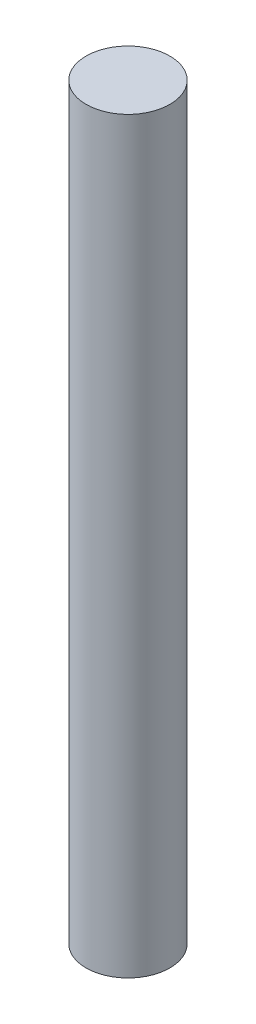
from build123d import *

# Parameters (mm, degrees)
SKETCH1_R           = 1.4224
BOSS_EXTRUDE1_DEPTH = 25.4


with BuildPart() as part:
    # Sketch1 → Boss-Extrude1 (new body)
    with BuildSketch(Plane(origin=(0, 0, 0), x_dir=(1, 0, 0), z_dir=(0, 1, 0))):
        with Locations(Location((0, 0, 0), (0, 0, 270))):
            Circle(SKETCH1_R)
    extrude(amount=BOSS_EXTRUDE1_DEPTH)


solid = part.part
